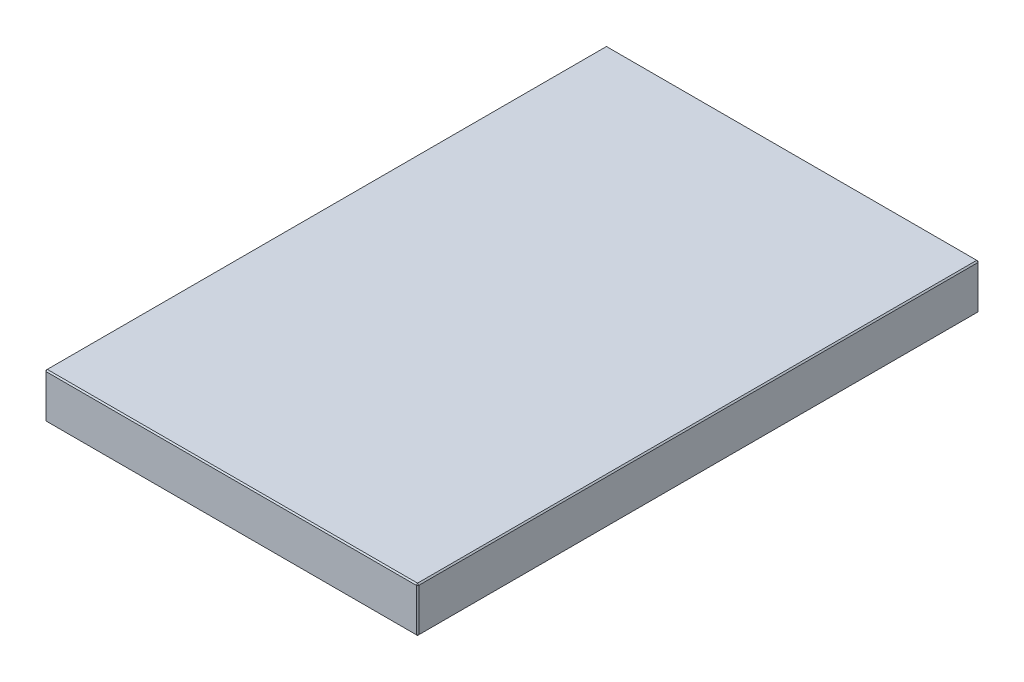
ISO-10303-21;
HEADER;
FILE_DESCRIPTION(('STEP AP214'),'2;1');
FILE_NAME('part.step','',(''),(''),'','','');
FILE_SCHEMA(('AUTOMOTIVE_DESIGN { 1 0 10303 214 1 1 1 1 }'));
ENDSEC;
DATA;
#1=APPLICATION_CONTEXT('core data for automotive mechanical design processes');
#2=APPLICATION_PROTOCOL_DEFINITION('international standard','automotive_design',2000,#1);
#3=PRODUCT_CONTEXT('',#1,'mechanical');
#4=PRODUCT('Part','Part','',(#3));
#5=PRODUCT_RELATED_PRODUCT_CATEGORY('part','',(#4));
#6=PRODUCT_DEFINITION_FORMATION('','',#4);
#7=PRODUCT_DEFINITION_CONTEXT('part definition',#1,'design');
#8=PRODUCT_DEFINITION('design','',#6,#7);
#9=PRODUCT_DEFINITION_SHAPE('','',#8);
#10=(LENGTH_UNIT() NAMED_UNIT(*) SI_UNIT(.MILLI.,.METRE.));
#11=(NAMED_UNIT(*) PLANE_ANGLE_UNIT() SI_UNIT($,.RADIAN.));
#12=(NAMED_UNIT(*) SI_UNIT($,.STERADIAN.) SOLID_ANGLE_UNIT());
#13=UNCERTAINTY_MEASURE_WITH_UNIT(LENGTH_MEASURE(1.E-05),#10,'distance_accuracy_value','');
#14=(GEOMETRIC_REPRESENTATION_CONTEXT(3) GLOBAL_UNCERTAINTY_ASSIGNED_CONTEXT((#13)) GLOBAL_UNIT_ASSIGNED_CONTEXT((#10,
#11,#12)) REPRESENTATION_CONTEXT('',''));
#15=CARTESIAN_POINT('',(0.,0.,0.));
#16=DIRECTION('',(0.,0.,1.));
#17=DIRECTION('',(1.,0.,0.));
#18=AXIS2_PLACEMENT_3D('',#15,#16,#17);
#19=CARTESIAN_POINT('',(-148.,36.,223.));
#20=DIRECTION('',(1.,0.,0.));
#21=DIRECTION('',(0.,0.,-1.));
#22=AXIS2_PLACEMENT_3D('',#19,#20,#21);
#23=PLANE('',#22);
#24=DIRECTION('',(0.,-1.,0.));
#25=VECTOR('',#24,1.);
#26=CARTESIAN_POINT('',(-148.,36.,-222.));
#27=LINE('',#26,#25);
#28=CARTESIAN_POINT('',(-148.,35.,-222.));
#29=VERTEX_POINT('',#28);
#30=CARTESIAN_POINT('',(-148.,1.,-222.));
#31=VERTEX_POINT('',#30);
#32=EDGE_CURVE('E114',#29,#31,#27,.T.);
#33=ORIENTED_EDGE('',*,*,#32,.T.);
#34=DIRECTION('',(0.,0.,1.));
#35=VECTOR('',#34,1.);
#36=CARTESIAN_POINT('',(-148.,1.,223.));
#37=LINE('',#36,#35);
#38=CARTESIAN_POINT('',(-148.,1.,222.));
#39=VERTEX_POINT('',#38);
#40=EDGE_CURVE('E110',#31,#39,#37,.T.);
#41=ORIENTED_EDGE('',*,*,#40,.T.);
#42=DIRECTION('',(0.,1.,0.));
#43=VECTOR('',#42,1.);
#44=CARTESIAN_POINT('',(-148.,36.,222.));
#45=LINE('',#44,#43);
#46=CARTESIAN_POINT('',(-148.,35.,222.));
#47=VERTEX_POINT('',#46);
#48=EDGE_CURVE('E103',#39,#47,#45,.T.);
#49=ORIENTED_EDGE('',*,*,#48,.T.);
#50=DIRECTION('',(0.,0.,-1.));
#51=VECTOR('',#50,1.);
#52=CARTESIAN_POINT('',(-148.,35.,-223.));
#53=LINE('',#52,#51);
#54=EDGE_CURVE('E107',#47,#29,#53,.T.);
#55=ORIENTED_EDGE('',*,*,#54,.T.);
#56=EDGE_LOOP('',(#33,#41,#49,#55));
#57=FACE_BOUND('',#56,.T.);
#58=ADVANCED_FACE('F15',(#57),#23,.F.);
#59=CARTESIAN_POINT('',(148.,36.,223.));
#60=DIRECTION('',(0.,0.,-1.));
#61=DIRECTION('',(-1.,0.,0.));
#62=AXIS2_PLACEMENT_3D('',#59,#60,#61);
#63=PLANE('',#62);
#64=DIRECTION('',(-1.,0.,0.));
#65=VECTOR('',#64,1.);
#66=CARTESIAN_POINT('',(-148.,35.,223.));
#67=LINE('',#66,#65);
#68=CARTESIAN_POINT('',(147.,35.,223.));
#69=VERTEX_POINT('',#68);
#70=CARTESIAN_POINT('',(-147.,35.,223.));
#71=VERTEX_POINT('',#70);
#72=EDGE_CURVE('E164',#69,#71,#67,.T.);
#73=ORIENTED_EDGE('',*,*,#72,.T.);
#74=DIRECTION('',(0.,-1.,0.));
#75=VECTOR('',#74,1.);
#76=CARTESIAN_POINT('',(-147.,36.,223.));
#77=LINE('',#76,#75);
#78=CARTESIAN_POINT('',(-147.,1.00000000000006,223.));
#79=VERTEX_POINT('',#78);
#80=EDGE_CURVE('E122',#71,#79,#77,.T.);
#81=ORIENTED_EDGE('',*,*,#80,.T.);
#82=DIRECTION('',(1.,0.,0.));
#83=VECTOR('',#82,1.);
#84=CARTESIAN_POINT('',(148.,1.00000000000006,223.));
#85=LINE('',#84,#83);
#86=CARTESIAN_POINT('',(147.,1.00000000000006,223.));
#87=VERTEX_POINT('',#86);
#88=EDGE_CURVE('E168',#79,#87,#85,.T.);
#89=ORIENTED_EDGE('',*,*,#88,.T.);
#90=DIRECTION('',(0.,1.,0.));
#91=VECTOR('',#90,1.);
#92=CARTESIAN_POINT('',(147.,36.,223.));
#93=LINE('',#92,#91);
#94=EDGE_CURVE('E166',#87,#69,#93,.T.);
#95=ORIENTED_EDGE('',*,*,#94,.T.);
#96=EDGE_LOOP('',(#73,#81,#89,#95));
#97=FACE_BOUND('',#96,.T.);
#98=ADVANCED_FACE('F275',(#97),#63,.F.);
#99=CARTESIAN_POINT('',(148.,36.,223.));
#100=DIRECTION('',(-1.,0.,0.));
#101=DIRECTION('',(0.,0.,1.));
#102=AXIS2_PLACEMENT_3D('',#99,#100,#101);
#103=PLANE('',#102);
#104=DIRECTION('',(0.,0.,-1.));
#105=VECTOR('',#104,1.);
#106=CARTESIAN_POINT('',(148.,1.00000000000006,223.));
#107=LINE('',#106,#105);
#108=CARTESIAN_POINT('',(148.,1.00000000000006,222.));
#109=VERTEX_POINT('',#108);
#110=CARTESIAN_POINT('',(148.,1.00000000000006,-222.));
#111=VERTEX_POINT('',#110);
#112=EDGE_CURVE('E159',#109,#111,#107,.T.);
#113=ORIENTED_EDGE('',*,*,#112,.T.);
#114=DIRECTION('',(0.,1.,0.));
#115=VECTOR('',#114,1.);
#116=CARTESIAN_POINT('',(148.,36.,-222.));
#117=LINE('',#116,#115);
#118=CARTESIAN_POINT('',(148.,35.,-222.));
#119=VERTEX_POINT('',#118);
#120=EDGE_CURVE('E161',#111,#119,#117,.T.);
#121=ORIENTED_EDGE('',*,*,#120,.T.);
#122=DIRECTION('',(0.,0.,1.));
#123=VECTOR('',#122,1.);
#124=CARTESIAN_POINT('',(148.,35.,223.));
#125=LINE('',#124,#123);
#126=CARTESIAN_POINT('',(148.,35.,222.));
#127=VERTEX_POINT('',#126);
#128=EDGE_CURVE('E155',#119,#127,#125,.T.);
#129=ORIENTED_EDGE('',*,*,#128,.T.);
#130=DIRECTION('',(0.,-1.,0.));
#131=VECTOR('',#130,1.);
#132=CARTESIAN_POINT('',(148.,36.,222.));
#133=LINE('',#132,#131);
#134=EDGE_CURVE('E157',#127,#109,#133,.T.);
#135=ORIENTED_EDGE('',*,*,#134,.T.);
#136=EDGE_LOOP('',(#113,#121,#129,#135));
#137=FACE_BOUND('',#136,.T.);
#138=ADVANCED_FACE('F254',(#137),#103,.F.);
#139=CARTESIAN_POINT('',(148.,36.,-223.));
#140=DIRECTION('',(0.,0.,1.));
#141=DIRECTION('',(1.,0.,0.));
#142=AXIS2_PLACEMENT_3D('',#139,#140,#141);
#143=PLANE('',#142);
#144=DIRECTION('',(0.,-1.,0.));
#145=VECTOR('',#144,1.);
#146=CARTESIAN_POINT('',(147.,36.,-223.));
#147=LINE('',#146,#145);
#148=CARTESIAN_POINT('',(147.,35.,-223.));
#149=VERTEX_POINT('',#148);
#150=CARTESIAN_POINT('',(147.,1.00000000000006,-223.));
#151=VERTEX_POINT('',#150);
#152=EDGE_CURVE('E148',#149,#151,#147,.T.);
#153=ORIENTED_EDGE('',*,*,#152,.T.);
#154=DIRECTION('',(-1.,0.,0.));
#155=VECTOR('',#154,1.);
#156=CARTESIAN_POINT('',(148.,1.00000000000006,-223.));
#157=LINE('',#156,#155);
#158=CARTESIAN_POINT('',(-147.,1.00000000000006,-223.));
#159=VERTEX_POINT('',#158);
#160=EDGE_CURVE('E153',#151,#159,#157,.T.);
#161=ORIENTED_EDGE('',*,*,#160,.T.);
#162=DIRECTION('',(0.,1.,0.));
#163=VECTOR('',#162,1.);
#164=CARTESIAN_POINT('',(-147.,36.,-223.));
#165=LINE('',#164,#163);
#166=CARTESIAN_POINT('',(-147.,35.,-223.));
#167=VERTEX_POINT('',#166);
#168=EDGE_CURVE('E150',#159,#167,#165,.T.);
#169=ORIENTED_EDGE('',*,*,#168,.T.);
#170=DIRECTION('',(1.,0.,0.));
#171=VECTOR('',#170,1.);
#172=CARTESIAN_POINT('',(148.,35.,-223.));
#173=LINE('',#172,#171);
#174=EDGE_CURVE('E146',#167,#149,#173,.T.);
#175=ORIENTED_EDGE('',*,*,#174,.T.);
#176=EDGE_LOOP('',(#153,#161,#169,#175));
#177=FACE_BOUND('',#176,.T.);
#178=ADVANCED_FACE('F284',(#177),#143,.F.);
#179=CARTESIAN_POINT('',(0.,36.,0.));
#180=DIRECTION('',(0.,1.,0.));
#181=DIRECTION('',(0.,0.,1.));
#182=AXIS2_PLACEMENT_3D('',#179,#180,#181);
#183=PLANE('',#182);
#184=DIRECTION('',(0.,0.,-1.));
#185=VECTOR('',#184,1.);
#186=CARTESIAN_POINT('',(147.,36.,-223.));
#187=LINE('',#186,#185);
#188=CARTESIAN_POINT('',(147.,36.,222.));
#189=VERTEX_POINT('',#188);
#190=CARTESIAN_POINT('',(147.,36.,-222.));
#191=VERTEX_POINT('',#190);
#192=EDGE_CURVE('E24',#189,#191,#187,.T.);
#193=ORIENTED_EDGE('',*,*,#192,.T.);
#194=DIRECTION('',(-1.,0.,0.));
#195=VECTOR('',#194,1.);
#196=CARTESIAN_POINT('',(-148.,36.,-222.));
#197=LINE('',#196,#195);
#198=CARTESIAN_POINT('',(-147.,36.,-222.));
#199=VERTEX_POINT('',#198);
#200=EDGE_CURVE('E9',#191,#199,#197,.T.);
#201=ORIENTED_EDGE('',*,*,#200,.T.);
#202=DIRECTION('',(0.,0.,1.));
#203=VECTOR('',#202,1.);
#204=CARTESIAN_POINT('',(-147.,36.,223.));
#205=LINE('',#204,#203);
#206=CARTESIAN_POINT('',(-147.,36.,222.));
#207=VERTEX_POINT('',#206);
#208=EDGE_CURVE('E180',#199,#207,#205,.T.);
#209=ORIENTED_EDGE('',*,*,#208,.T.);
#210=DIRECTION('',(1.,0.,0.));
#211=VECTOR('',#210,1.);
#212=CARTESIAN_POINT('',(148.,36.,222.));
#213=LINE('',#212,#211);
#214=EDGE_CURVE('E35',#207,#189,#213,.T.);
#215=ORIENTED_EDGE('',*,*,#214,.T.);
#216=EDGE_LOOP('',(#193,#201,#209,#215));
#217=FACE_BOUND('',#216,.T.);
#218=ADVANCED_FACE('F350',(#217),#183,.T.);
#219=CARTESIAN_POINT('',(0.,0.,0.));
#220=DIRECTION('',(0.,1.,0.));
#221=DIRECTION('',(0.,0.,1.));
#222=AXIS2_PLACEMENT_3D('',#219,#220,#221);
#223=PLANE('',#222);
#224=DIRECTION('',(0.,0.,1.));
#225=VECTOR('',#224,1.);
#226=CARTESIAN_POINT('',(147.,0.,0.));
#227=LINE('',#226,#225);
#228=CARTESIAN_POINT('',(147.,0.,-222.));
#229=VERTEX_POINT('',#228);
#230=CARTESIAN_POINT('',(147.,0.,222.));
#231=VERTEX_POINT('',#230);
#232=EDGE_CURVE('E171',#229,#231,#227,.T.);
#233=ORIENTED_EDGE('',*,*,#232,.T.);
#234=DIRECTION('',(-1.,0.,0.));
#235=VECTOR('',#234,1.);
#236=CARTESIAN_POINT('',(0.,0.,222.));
#237=LINE('',#236,#235);
#238=CARTESIAN_POINT('',(-147.,0.,222.));
#239=VERTEX_POINT('',#238);
#240=EDGE_CURVE('E177',#231,#239,#237,.T.);
#241=ORIENTED_EDGE('',*,*,#240,.T.);
#242=DIRECTION('',(0.,0.,-1.));
#243=VECTOR('',#242,1.);
#244=CARTESIAN_POINT('',(-147.,0.,0.));
#245=LINE('',#244,#243);
#246=CARTESIAN_POINT('',(-147.,0.,-222.));
#247=VERTEX_POINT('',#246);
#248=EDGE_CURVE('E175',#239,#247,#245,.T.);
#249=ORIENTED_EDGE('',*,*,#248,.T.);
#250=DIRECTION('',(1.,0.,0.));
#251=VECTOR('',#250,1.);
#252=CARTESIAN_POINT('',(0.,0.,-222.));
#253=LINE('',#252,#251);
#254=EDGE_CURVE('E173',#247,#229,#253,.T.);
#255=ORIENTED_EDGE('',*,*,#254,.T.);
#256=EDGE_LOOP('',(#233,#241,#249,#255));
#257=FACE_BOUND('',#256,.T.);
#258=ADVANCED_FACE('F246',(#257),#223,.F.);
#259=CARTESIAN_POINT('',(148.,36.,222.));
#260=DIRECTION('',(-0.707106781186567,0.,-0.707106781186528));
#261=DIRECTION('',(0.,-1.,0.));
#262=AXIS2_PLACEMENT_3D('',#259,#260,#261);
#263=PLANE('',#262);
#264=DIRECTION('',(-0.707106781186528,0.,0.707106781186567));
#265=VECTOR('',#264,1.);
#266=CARTESIAN_POINT('',(147.,35.,223.));
#267=LINE('',#266,#265);
#268=EDGE_CURVE('E19',#69,#127,#267,.F.);
#269=ORIENTED_EDGE('',*,*,#268,.F.);
#270=ORIENTED_EDGE('',*,*,#94,.F.);
#271=DIRECTION('',(0.707106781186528,0.,-0.707106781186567));
#272=VECTOR('',#271,1.);
#273=CARTESIAN_POINT('',(147.,1.00000000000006,223.));
#274=LINE('',#273,#272);
#275=EDGE_CURVE('E142',#109,#87,#274,.F.);
#276=ORIENTED_EDGE('',*,*,#275,.F.);
#277=ORIENTED_EDGE('',*,*,#134,.F.);
#278=EDGE_LOOP('',(#269,#270,#276,#277));
#279=FACE_BOUND('',#278,.T.);
#280=ADVANCED_FACE('F17',(#279),#263,.F.);
#281=CARTESIAN_POINT('',(147.,35.,223.));
#282=DIRECTION('',(0.577350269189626,0.577350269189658,0.577350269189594));
#283=DIRECTION('',(-0.707106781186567,0.707106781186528,0.));
#284=AXIS2_PLACEMENT_3D('',#281,#282,#283);
#285=PLANE('',#284);
#286=DIRECTION('',(0.,-0.707106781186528,0.707106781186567));
#287=VECTOR('',#286,1.);
#288=CARTESIAN_POINT('',(147.,35.,223.));
#289=LINE('',#288,#287);
#290=EDGE_CURVE('E226',#69,#189,#289,.F.);
#291=ORIENTED_EDGE('',*,*,#290,.F.);
#292=ORIENTED_EDGE('',*,*,#268,.T.);
#293=DIRECTION('',(-0.707106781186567,0.707106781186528,0.));
#294=VECTOR('',#293,1.);
#295=CARTESIAN_POINT('',(147.5,35.5,222.));
#296=LINE('',#295,#294);
#297=EDGE_CURVE('E228',#189,#127,#296,.F.);
#298=ORIENTED_EDGE('',*,*,#297,.F.);
#299=EDGE_LOOP('',(#291,#292,#298));
#300=FACE_BOUND('',#299,.T.);
#301=ADVANCED_FACE('F270',(#300),#285,.T.);
#302=CARTESIAN_POINT('',(147.,1.00000000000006,223.));
#303=DIRECTION('',(0.577350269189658,-0.577350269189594,0.577350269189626));
#304=DIRECTION('',(0.707106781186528,0.,-0.707106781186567));
#305=AXIS2_PLACEMENT_3D('',#302,#303,#304);
#306=PLANE('',#305);
#307=DIRECTION('',(-0.707106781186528,-0.707106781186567,0.));
#308=VECTOR('',#307,1.);
#309=CARTESIAN_POINT('',(147.5,0.500000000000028,222.));
#310=LINE('',#309,#308);
#311=EDGE_CURVE('E220',#109,#231,#310,.T.);
#312=ORIENTED_EDGE('',*,*,#311,.F.);
#313=ORIENTED_EDGE('',*,*,#275,.T.);
#314=DIRECTION('',(0.,0.707106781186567,0.707106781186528));
#315=VECTOR('',#314,1.);
#316=CARTESIAN_POINT('',(147.,1.00000000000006,223.));
#317=LINE('',#316,#315);
#318=EDGE_CURVE('E223',#231,#87,#317,.T.);
#319=ORIENTED_EDGE('',*,*,#318,.F.);
#320=EDGE_LOOP('',(#312,#313,#319));
#321=FACE_BOUND('',#320,.T.);
#322=ADVANCED_FACE('F235',(#321),#306,.T.);
#323=CARTESIAN_POINT('',(147.,36.,0.));
#324=DIRECTION('',(0.707106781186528,0.707106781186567,0.));
#325=DIRECTION('',(0.,0.,1.));
#326=AXIS2_PLACEMENT_3D('',#323,#324,#325);
#327=PLANE('',#326);
#328=ORIENTED_EDGE('',*,*,#297,.T.);
#329=ORIENTED_EDGE('',*,*,#128,.F.);
#330=DIRECTION('',(0.707106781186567,-0.707106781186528,0.));
#331=VECTOR('',#330,1.);
#332=CARTESIAN_POINT('',(148.,35.,-222.));
#333=LINE('',#332,#331);
#334=EDGE_CURVE('E215',#191,#119,#333,.T.);
#335=ORIENTED_EDGE('',*,*,#334,.F.);
#336=ORIENTED_EDGE('',*,*,#192,.F.);
#337=EDGE_LOOP('',(#328,#329,#335,#336));
#338=FACE_BOUND('',#337,.T.);
#339=ADVANCED_FACE('F265',(#338),#327,.T.);
#340=CARTESIAN_POINT('',(0.,36.,222.));
#341=DIRECTION('',(0.,0.707106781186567,0.707106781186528));
#342=DIRECTION('',(-1.,0.,0.));
#343=AXIS2_PLACEMENT_3D('',#340,#341,#342);
#344=PLANE('',#343);
#345=ORIENTED_EDGE('',*,*,#290,.T.);
#346=ORIENTED_EDGE('',*,*,#214,.F.);
#347=DIRECTION('',(0.,0.707106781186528,-0.707106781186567));
#348=VECTOR('',#347,1.);
#349=CARTESIAN_POINT('',(-147.,35.5,222.5));
#350=LINE('',#349,#348);
#351=EDGE_CURVE('E126',#71,#207,#350,.T.);
#352=ORIENTED_EDGE('',*,*,#351,.F.);
#353=ORIENTED_EDGE('',*,*,#72,.F.);
#354=EDGE_LOOP('',(#345,#346,#352,#353));
#355=FACE_BOUND('',#354,.T.);
#356=ADVANCED_FACE('F273',(#355),#344,.T.);
#357=CARTESIAN_POINT('',(-147.,36.,223.));
#358=DIRECTION('',(0.707106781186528,0.,-0.707106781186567));
#359=DIRECTION('',(0.,-1.,0.));
#360=AXIS2_PLACEMENT_3D('',#357,#358,#359);
#361=PLANE('',#360);
#362=DIRECTION('',(0.707106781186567,0.,0.707106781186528));
#363=VECTOR('',#362,1.);
#364=CARTESIAN_POINT('',(-147.,1.00000000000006,223.));
#365=LINE('',#364,#363);
#366=EDGE_CURVE('E127',#79,#39,#365,.F.);
#367=ORIENTED_EDGE('',*,*,#366,.F.);
#368=ORIENTED_EDGE('',*,*,#80,.F.);
#369=DIRECTION('',(-0.707106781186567,0.,-0.707106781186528));
#370=VECTOR('',#369,1.);
#371=CARTESIAN_POINT('',(-148.,35.,222.));
#372=LINE('',#371,#370);
#373=EDGE_CURVE('E118',#47,#71,#372,.F.);
#374=ORIENTED_EDGE('',*,*,#373,.F.);
#375=ORIENTED_EDGE('',*,*,#48,.F.);
#376=EDGE_LOOP('',(#367,#368,#374,#375));
#377=FACE_BOUND('',#376,.T.);
#378=ADVANCED_FACE('F120',(#377),#361,.F.);
#379=CARTESIAN_POINT('',(148.,1.00000000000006,223.));
#380=DIRECTION('',(0.,0.707106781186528,-0.707106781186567));
#381=DIRECTION('',(1.,0.,0.));
#382=AXIS2_PLACEMENT_3D('',#379,#380,#381);
#383=PLANE('',#382);
#384=ORIENTED_EDGE('',*,*,#318,.T.);
#385=ORIENTED_EDGE('',*,*,#88,.F.);
#386=DIRECTION('',(0.,-0.707106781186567,-0.707106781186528));
#387=VECTOR('',#386,1.);
#388=CARTESIAN_POINT('',(-147.,1.00000000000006,223.));
#389=LINE('',#388,#387);
#390=EDGE_CURVE('E211',#239,#79,#389,.F.);
#391=ORIENTED_EDGE('',*,*,#390,.F.);
#392=ORIENTED_EDGE('',*,*,#240,.F.);
#393=EDGE_LOOP('',(#384,#385,#391,#392));
#394=FACE_BOUND('',#393,.T.);
#395=ADVANCED_FACE('F243',(#394),#383,.F.);
#396=CARTESIAN_POINT('',(148.,1.00000000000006,223.));
#397=DIRECTION('',(-0.707106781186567,0.707106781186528,0.));
#398=DIRECTION('',(0.,0.,-1.));
#399=AXIS2_PLACEMENT_3D('',#396,#397,#398);
#400=PLANE('',#399);
#401=ORIENTED_EDGE('',*,*,#311,.T.);
#402=ORIENTED_EDGE('',*,*,#232,.F.);
#403=DIRECTION('',(0.707106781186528,0.707106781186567,0.));
#404=VECTOR('',#403,1.);
#405=CARTESIAN_POINT('',(147.5,0.500000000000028,-222.));
#406=LINE('',#405,#404);
#407=EDGE_CURVE('E208',#111,#229,#406,.F.);
#408=ORIENTED_EDGE('',*,*,#407,.F.);
#409=ORIENTED_EDGE('',*,*,#112,.F.);
#410=EDGE_LOOP('',(#401,#402,#408,#409));
#411=FACE_BOUND('',#410,.T.);
#412=ADVANCED_FACE('F251',(#411),#400,.F.);
#413=CARTESIAN_POINT('',(147.,36.,-223.));
#414=DIRECTION('',(-0.707106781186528,0.,0.707106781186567));
#415=DIRECTION('',(0.,-1.,0.));
#416=AXIS2_PLACEMENT_3D('',#413,#414,#415);
#417=PLANE('',#416);
#418=DIRECTION('',(0.707106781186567,0.,0.707106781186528));
#419=VECTOR('',#418,1.);
#420=CARTESIAN_POINT('',(148.,35.,-222.));
#421=LINE('',#420,#419);
#422=EDGE_CURVE('E217',#119,#149,#421,.F.);
#423=ORIENTED_EDGE('',*,*,#422,.F.);
#424=ORIENTED_EDGE('',*,*,#120,.F.);
#425=DIRECTION('',(-0.707106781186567,0.,-0.707106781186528));
#426=VECTOR('',#425,1.);
#427=CARTESIAN_POINT('',(147.,1.00000000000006,-223.));
#428=LINE('',#427,#426);
#429=EDGE_CURVE('E205',#151,#111,#428,.F.);
#430=ORIENTED_EDGE('',*,*,#429,.F.);
#431=ORIENTED_EDGE('',*,*,#152,.F.);
#432=EDGE_LOOP('',(#423,#424,#430,#431));
#433=FACE_BOUND('',#432,.T.);
#434=ADVANCED_FACE('F258',(#433),#417,.F.);
#435=CARTESIAN_POINT('',(148.,35.,-222.));
#436=DIRECTION('',(0.577350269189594,0.577350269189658,-0.577350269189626));
#437=DIRECTION('',(0.,0.707106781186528,0.707106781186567));
#438=AXIS2_PLACEMENT_3D('',#435,#436,#437);
#439=PLANE('',#438);
#440=ORIENTED_EDGE('',*,*,#334,.T.);
#441=ORIENTED_EDGE('',*,*,#422,.T.);
#442=DIRECTION('',(0.,0.707106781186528,0.707106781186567));
#443=VECTOR('',#442,1.);
#444=CARTESIAN_POINT('',(147.,35.5,-222.5));
#445=LINE('',#444,#443);
#446=EDGE_CURVE('E134',#191,#149,#445,.F.);
#447=ORIENTED_EDGE('',*,*,#446,.F.);
#448=EDGE_LOOP('',(#440,#441,#447));
#449=FACE_BOUND('',#448,.T.);
#450=ADVANCED_FACE('F325',(#449),#439,.T.);
#451=CARTESIAN_POINT('',(-148.,35.,222.));
#452=DIRECTION('',(-0.577350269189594,0.577350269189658,0.577350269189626));
#453=DIRECTION('',(0.,-0.707106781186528,0.707106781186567));
#454=AXIS2_PLACEMENT_3D('',#451,#452,#453);
#455=PLANE('',#454);
#456=ORIENTED_EDGE('',*,*,#373,.T.);
#457=ORIENTED_EDGE('',*,*,#351,.T.);
#458=DIRECTION('',(-0.707106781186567,-0.707106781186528,0.));
#459=VECTOR('',#458,1.);
#460=CARTESIAN_POINT('',(-148.,35.,222.));
#461=LINE('',#460,#459);
#462=EDGE_CURVE('E130',#47,#207,#461,.F.);
#463=ORIENTED_EDGE('',*,*,#462,.F.);
#464=EDGE_LOOP('',(#456,#457,#463));
#465=FACE_BOUND('',#464,.T.);
#466=ADVANCED_FACE('F131',(#465),#455,.T.);
#467=CARTESIAN_POINT('',(-147.,1.00000000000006,223.));
#468=DIRECTION('',(-0.577350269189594,-0.577350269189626,0.577350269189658));
#469=DIRECTION('',(0.,-0.707106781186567,-0.707106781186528));
#470=AXIS2_PLACEMENT_3D('',#467,#468,#469);
#471=PLANE('',#470);
#472=ORIENTED_EDGE('',*,*,#390,.T.);
#473=ORIENTED_EDGE('',*,*,#366,.T.);
#474=DIRECTION('',(-0.707106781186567,0.707106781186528,0.));
#475=VECTOR('',#474,1.);
#476=CARTESIAN_POINT('',(-147.5,0.5,222.));
#477=LINE('',#476,#475);
#478=EDGE_CURVE('E135',#239,#39,#477,.T.);
#479=ORIENTED_EDGE('',*,*,#478,.F.);
#480=EDGE_LOOP('',(#472,#473,#479));
#481=FACE_BOUND('',#480,.T.);
#482=ADVANCED_FACE('F318',(#481),#471,.T.);
#483=CARTESIAN_POINT('',(147.,1.00000000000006,-223.));
#484=DIRECTION('',(0.577350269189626,-0.577350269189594,-0.577350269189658));
#485=DIRECTION('',(-0.707106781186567,0.,-0.707106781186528));
#486=AXIS2_PLACEMENT_3D('',#483,#484,#485);
#487=PLANE('',#486);
#488=ORIENTED_EDGE('',*,*,#429,.T.);
#489=ORIENTED_EDGE('',*,*,#407,.T.);
#490=DIRECTION('',(0.,-0.707106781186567,0.707106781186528));
#491=VECTOR('',#490,1.);
#492=CARTESIAN_POINT('',(147.,1.00000000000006,-223.));
#493=LINE('',#492,#491);
#494=EDGE_CURVE('E198',#151,#229,#493,.T.);
#495=ORIENTED_EDGE('',*,*,#494,.F.);
#496=EDGE_LOOP('',(#488,#489,#495));
#497=FACE_BOUND('',#496,.T.);
#498=ADVANCED_FACE('F314',(#497),#487,.T.);
#499=CARTESIAN_POINT('',(0.,36.,-222.));
#500=DIRECTION('',(0.,0.707106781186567,-0.707106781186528));
#501=DIRECTION('',(1.,0.,0.));
#502=AXIS2_PLACEMENT_3D('',#499,#500,#501);
#503=PLANE('',#502);
#504=ORIENTED_EDGE('',*,*,#446,.T.);
#505=ORIENTED_EDGE('',*,*,#174,.F.);
#506=DIRECTION('',(0.,-0.707106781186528,-0.707106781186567));
#507=VECTOR('',#506,1.);
#508=CARTESIAN_POINT('',(-147.,35.,-223.));
#509=LINE('',#508,#507);
#510=EDGE_CURVE('E195',#199,#167,#509,.T.);
#511=ORIENTED_EDGE('',*,*,#510,.F.);
#512=ORIENTED_EDGE('',*,*,#200,.F.);
#513=EDGE_LOOP('',(#504,#505,#511,#512));
#514=FACE_BOUND('',#513,.T.);
#515=ADVANCED_FACE('F311',(#514),#503,.T.);
#516=CARTESIAN_POINT('',(-147.,36.,0.));
#517=DIRECTION('',(-0.707106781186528,0.707106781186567,0.));
#518=DIRECTION('',(0.,0.,-1.));
#519=AXIS2_PLACEMENT_3D('',#516,#517,#518);
#520=PLANE('',#519);
#521=ORIENTED_EDGE('',*,*,#462,.T.);
#522=ORIENTED_EDGE('',*,*,#208,.F.);
#523=DIRECTION('',(0.707106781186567,0.707106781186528,0.));
#524=VECTOR('',#523,1.);
#525=CARTESIAN_POINT('',(-147.5,35.5,-222.));
#526=LINE('',#525,#524);
#527=EDGE_CURVE('E138',#29,#199,#526,.T.);
#528=ORIENTED_EDGE('',*,*,#527,.F.);
#529=ORIENTED_EDGE('',*,*,#54,.F.);
#530=EDGE_LOOP('',(#521,#522,#528,#529));
#531=FACE_BOUND('',#530,.T.);
#532=ADVANCED_FACE('F137',(#531),#520,.T.);
#533=CARTESIAN_POINT('',(-148.,1.,223.));
#534=DIRECTION('',(0.707106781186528,0.707106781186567,0.));
#535=DIRECTION('',(0.,0.,1.));
#536=AXIS2_PLACEMENT_3D('',#533,#534,#535);
#537=PLANE('',#536);
#538=ORIENTED_EDGE('',*,*,#478,.T.);
#539=ORIENTED_EDGE('',*,*,#40,.F.);
#540=DIRECTION('',(0.707106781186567,-0.707106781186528,0.));
#541=VECTOR('',#540,1.);
#542=CARTESIAN_POINT('',(-148.,1.,-222.));
#543=LINE('',#542,#541);
#544=EDGE_CURVE('E191',#247,#31,#543,.F.);
#545=ORIENTED_EDGE('',*,*,#544,.F.);
#546=ORIENTED_EDGE('',*,*,#248,.F.);
#547=EDGE_LOOP('',(#538,#539,#545,#546));
#548=FACE_BOUND('',#547,.T.);
#549=ADVANCED_FACE('F304',(#548),#537,.F.);
#550=CARTESIAN_POINT('',(148.,1.00000000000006,-223.));
#551=DIRECTION('',(0.,0.707106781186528,0.707106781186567));
#552=DIRECTION('',(-1.,0.,0.));
#553=AXIS2_PLACEMENT_3D('',#550,#551,#552);
#554=PLANE('',#553);
#555=ORIENTED_EDGE('',*,*,#494,.T.);
#556=ORIENTED_EDGE('',*,*,#254,.F.);
#557=DIRECTION('',(0.,0.707106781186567,-0.707106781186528));
#558=VECTOR('',#557,1.);
#559=CARTESIAN_POINT('',(-147.,0.500000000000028,-222.5));
#560=LINE('',#559,#558);
#561=EDGE_CURVE('E188',#159,#247,#560,.F.);
#562=ORIENTED_EDGE('',*,*,#561,.F.);
#563=ORIENTED_EDGE('',*,*,#160,.F.);
#564=EDGE_LOOP('',(#555,#556,#562,#563));
#565=FACE_BOUND('',#564,.T.);
#566=ADVANCED_FACE('F300',(#565),#554,.F.);
#567=CARTESIAN_POINT('',(-147.,35.,-223.));
#568=DIRECTION('',(-0.577350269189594,0.577350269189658,-0.577350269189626));
#569=DIRECTION('',(0.,0.707106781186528,0.707106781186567));
#570=AXIS2_PLACEMENT_3D('',#567,#568,#569);
#571=PLANE('',#570);
#572=ORIENTED_EDGE('',*,*,#527,.T.);
#573=ORIENTED_EDGE('',*,*,#510,.T.);
#574=DIRECTION('',(0.707106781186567,0.,-0.707106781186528));
#575=VECTOR('',#574,1.);
#576=CARTESIAN_POINT('',(-147.,35.,-223.));
#577=LINE('',#576,#575);
#578=EDGE_CURVE('E186',#29,#167,#577,.T.);
#579=ORIENTED_EDGE('',*,*,#578,.F.);
#580=EDGE_LOOP('',(#572,#573,#579));
#581=FACE_BOUND('',#580,.T.);
#582=ADVANCED_FACE('F296',(#581),#571,.T.);
#583=CARTESIAN_POINT('',(-148.,1.,-222.));
#584=DIRECTION('',(-0.577350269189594,-0.577350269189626,-0.577350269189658));
#585=DIRECTION('',(0.,0.707106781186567,-0.707106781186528));
#586=AXIS2_PLACEMENT_3D('',#583,#584,#585);
#587=PLANE('',#586);
#588=ORIENTED_EDGE('',*,*,#561,.T.);
#589=ORIENTED_EDGE('',*,*,#544,.T.);
#590=DIRECTION('',(-0.707106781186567,0.,0.707106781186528));
#591=VECTOR('',#590,1.);
#592=CARTESIAN_POINT('',(-148.,1.,-222.));
#593=LINE('',#592,#591);
#594=EDGE_CURVE('E184',#159,#31,#593,.T.);
#595=ORIENTED_EDGE('',*,*,#594,.F.);
#596=EDGE_LOOP('',(#588,#589,#595));
#597=FACE_BOUND('',#596,.T.);
#598=ADVANCED_FACE('F292',(#597),#587,.T.);
#599=CARTESIAN_POINT('',(-148.,36.,-222.));
#600=DIRECTION('',(0.707106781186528,0.,0.707106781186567));
#601=DIRECTION('',(0.,-1.,0.));
#602=AXIS2_PLACEMENT_3D('',#599,#600,#601);
#603=PLANE('',#602);
#604=ORIENTED_EDGE('',*,*,#578,.T.);
#605=ORIENTED_EDGE('',*,*,#168,.F.);
#606=ORIENTED_EDGE('',*,*,#594,.T.);
#607=ORIENTED_EDGE('',*,*,#32,.F.);
#608=EDGE_LOOP('',(#604,#605,#606,#607));
#609=FACE_BOUND('',#608,.T.);
#610=ADVANCED_FACE('F289',(#609),#603,.F.);
#611=CLOSED_SHELL('',(#58,#98,#138,#178,#218,#258,#280,#301,#322,#339,#356,#378,#395,#412,#434,
#450,#466,#482,#498,#515,#532,#549,#566,#582,#598,#610));
#612=MANIFOLD_SOLID_BREP('B1',#611);
#613=ADVANCED_BREP_SHAPE_REPRESENTATION('',(#18,#612),#14);
#614=SHAPE_DEFINITION_REPRESENTATION(#9,#613);
ENDSEC;
END-ISO-10303-21;
